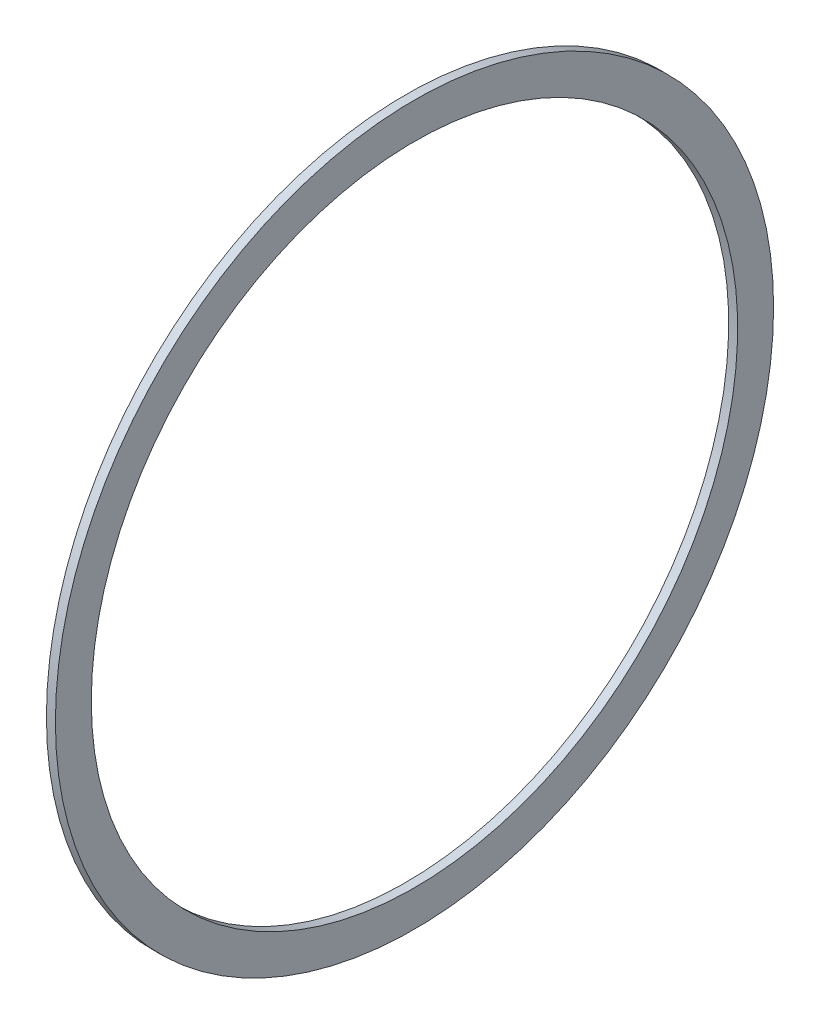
from build123d import *

# Parameters (mm, degrees)
SKETCH1_W = 3.175
SKETCH1_H = 12.7


with BuildPart() as part:
    # Sketch1 → Revolve1 (revolve)
    with BuildSketch(Plane(origin=(0, 0, 0), x_dir=(1, 0, 0), z_dir=(0, 1, 0)), mode=Mode.PRIVATE) as revolve1_sk:
        with Locations((1.5875, 120.65)):
            Rectangle(SKETCH1_W, SKETCH1_H)
    revolve(revolve1_sk.sketch.rotate(Axis((0, 0, 0), (1, 0, 0)), 180), axis=Axis((0, 0, 0), (1, 0, 0)))


solid = part.part
